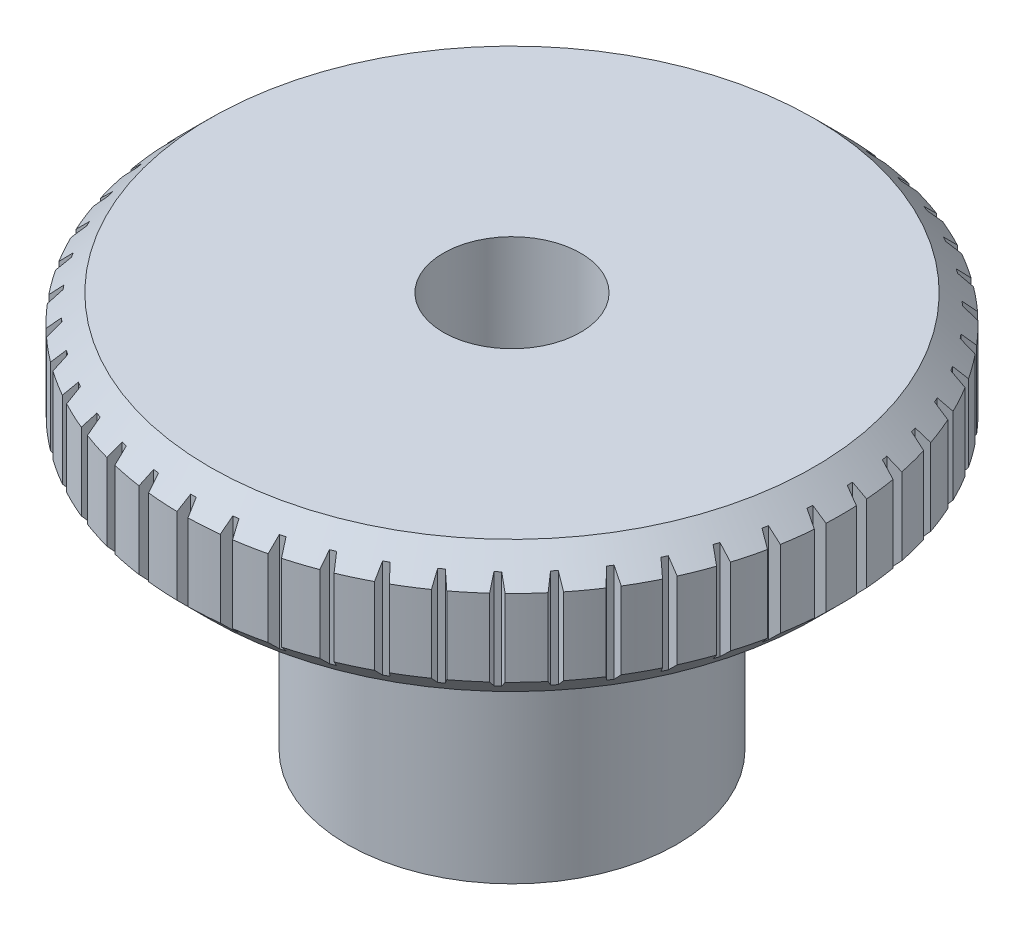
from build123d import *

# Parameters (mm, degrees)
CHAMFER_1_SIZE      = 0.5
CUT_EXTRUDE_1_DEPTH = 12.128342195


with BuildPart() as part:
    # Sketch 1 → Revolve 1 (revolve)
    with BuildSketch(Plane.XY, mode=Mode.PRIVATE) as revolve_1_sk:
        Polygon((1.25, 0), (1.25, 7.2), (6, 7.2), (6, 4.8), (3, 4.8), (3, 0), align=None)
    revolve(revolve_1_sk.sketch.rotate(Axis((0, 14.403409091, 0), (0, -1, 0)), 90), axis=Axis((0, 14.403409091, 0), (0, -1, 0)))

    # Chamfer 1
    chamfer_1_edges = [part.edges().sort_by_distance(p)[0] for p in [
        (0, 4.8, -6),
        (0, 7.2, -6),
    ]]
    chamfer(chamfer_1_edges, length=CHAMFER_1_SIZE)

    # Sketch 2 → Cut-Extrude 1 (cut, through all)
    with BuildSketch(Plane(origin=(0, 7.2, 0), x_dir=(1, 0, 0), z_dir=(0, 1, 0))):
        with BuildLine():
            Line((-0.1, 5.999166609), (-0.05, 5.8))
            Line((-0.05, 5.8), (0.05, 5.8))
            Line((0.05, 5.8), (0.1, 5.999166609))
            ThreePointArc((0.1, 5.999166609), (0, 6), (-0.1, 5.999166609))
        make_face()
        with BuildLine():
            Line((0.77653849, 5.747998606), (0.85110642, 5.939328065))
            ThreePointArc((0.85110642, 5.939328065), (0.751999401, 5.952688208), (0.65268348, 5.964394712))
            Line((0.65268348, 5.964394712), (0.67732702, 5.760531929))
            Line((0.67732702, 5.760531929), (0.77653849, 5.747998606))
        make_face()
        with BuildLine():
            Line((1.490830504, 5.60534784), (1.588790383, 5.785822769))
            ThreePointArc((1.588790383, 5.785822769), (1.492139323, 5.811498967), (1.395073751, 5.835560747))
            Line((1.395073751, 5.835560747), (1.393972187, 5.630216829))
            Line((1.393972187, 5.630216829), (1.490830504, 5.60534784))
        make_face()
        with BuildLine():
            Line((2.18161123, 5.374297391), (2.301418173, 5.541071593))
            ThreePointArc((2.301418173, 5.541071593), (2.208747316, 5.578658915), (2.115462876, 5.614696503))
            Line((2.115462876, 5.614696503), (2.088633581, 5.411109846))
            Line((2.088633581, 5.411109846), (2.18161123, 5.374297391))
        make_face()
        with BuildLine():
            Line((2.837986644, 5.058491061), (2.977751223, 5.208934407))
            ThreePointArc((2.977751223, 5.208934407), (2.890522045, 5.25784008), (2.802489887, 5.305285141))
            Line((2.802489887, 5.305285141), (2.750355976, 5.106666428))
            Line((2.750355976, 5.106666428), (2.837986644, 5.058491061))
        make_face()
        with BuildLine():
            Line((3.449605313, 4.662909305), (3.607123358, 4.794649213))
            ThreePointArc((3.607123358, 4.794649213), (3.526711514, 4.854101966), (3.445319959, 4.912206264))
            Line((3.445319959, 4.912206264), (3.368703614, 4.72168783))
            Line((3.368703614, 4.72168783), (3.449605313, 4.662909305))
        make_face()
        with BuildLine():
            Line((4.006821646, 4.193790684), (4.179609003, 4.304749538))
            ThreePointArc((4.179609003, 4.304749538), (4.107282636, 4.373811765), (4.033815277, 4.441658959))
            Line((4.033815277, 4.441658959), (3.933924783, 4.262245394))
            Line((3.933924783, 4.262245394), (4.006821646, 4.193790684))
        make_face()
        with BuildLine():
            Line((4.500848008, 3.658533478), (4.686179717, 3.746961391))
            ThreePointArc((4.686179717, 3.746961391), (4.623079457, 3.824543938), (4.558694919, 3.901064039))
            Line((4.558694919, 3.901064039), (4.437105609, 3.735584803))
            Line((4.437105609, 3.735584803), (4.500848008, 3.658533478))
        make_face()
        with BuildLine():
            Line((4.923893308, 3.065579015), (5.118846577, 3.130081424))
            ThreePointArc((5.118846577, 3.130081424), (5.065967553, 3.21496077), (5.011681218, 3.298947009))
            Line((5.011681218, 3.298947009), (4.870310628, 3.150011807))
            Line((4.870310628, 3.150011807), (4.923893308, 3.065579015))
        make_face()
        with BuildLine():
            Line((5.269285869, 2.424278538), (5.470786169, 2.463838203))
            ThreePointArc((5.470786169, 2.463838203), (5.428962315, 2.554675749), (5.385630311, 2.644803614))
            Line((5.385630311, 2.644803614), (5.22670794, 2.514761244))
            Line((5.22670794, 2.514761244), (5.269285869, 2.424278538))
        make_face()
        with BuildLine():
            Line((5.531578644, 1.744745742), (5.736448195, 1.758738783))
            ThreePointArc((5.736448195, 1.758738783), (5.706339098, 1.854101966), (5.674644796, 1.948950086))
            Line((5.674644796, 1.948950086), (5.500676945, 1.839851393))
            Line((5.500676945, 1.839851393), (5.531578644, 1.744745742))
        make_face()
        with BuildLine():
            Line((5.70663512, 1.037697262), (5.911643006, 1.025903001))
            ThreePointArc((5.911643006, 1.025903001), (5.893723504, 1.124287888), (5.874166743, 1.222360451))
            Line((5.874166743, 1.222360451), (5.687896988, 1.135925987))
            Line((5.687896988, 1.135925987), (5.70663512, 1.037697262))
        make_face()
        with BuildLine():
            Line((5.791694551, 0.314283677), (5.993607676, 0.276888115))
            ThreePointArc((5.993607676, 0.276888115), (5.988160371, 0.376743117), (5.981049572, 0.476493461))
            Line((5.981049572, 0.476493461), (5.785415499, 0.41408635))
            Line((5.785415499, 0.41408635), (5.791694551, 0.314283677))
        make_face()
        with BuildLine():
            Line((5.785415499, -0.41408635), (5.981049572, -0.476493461))
            ThreePointArc((5.981049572, -0.476493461), (5.988160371, -0.376743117), (5.993607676, -0.276888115))
            Line((5.993607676, -0.276888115), (5.791694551, -0.314283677))
            Line((5.791694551, -0.314283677), (5.785415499, -0.41408635))
        make_face()
        with BuildLine():
            Line((5.687896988, -1.135925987), (5.874166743, -1.222360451))
            ThreePointArc((5.874166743, -1.222360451), (5.893723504, -1.124287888), (5.911643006, -1.025903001))
            Line((5.911643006, -1.025903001), (5.70663512, -1.037697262))
            Line((5.70663512, -1.037697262), (5.687896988, -1.135925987))
        make_face()
        with BuildLine():
            Line((5.500676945, -1.839851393), (5.674644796, -1.948950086))
            ThreePointArc((5.674644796, -1.948950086), (5.706339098, -1.854101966), (5.736448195, -1.758738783))
            Line((5.736448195, -1.758738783), (5.531578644, -1.744745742))
            Line((5.531578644, -1.744745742), (5.500676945, -1.839851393))
        make_face()
        with BuildLine():
            Line((5.22670794, -2.514761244), (5.385630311, -2.644803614))
            ThreePointArc((5.385630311, -2.644803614), (5.428962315, -2.554675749), (5.470786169, -2.463838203))
            Line((5.470786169, -2.463838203), (5.269285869, -2.424278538))
            Line((5.269285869, -2.424278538), (5.22670794, -2.514761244))
        make_face()
        with BuildLine():
            Line((4.870310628, -3.150011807), (5.011681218, -3.298947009))
            ThreePointArc((5.011681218, -3.298947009), (5.065967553, -3.21496077), (5.118846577, -3.130081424))
            Line((5.118846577, -3.130081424), (4.923893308, -3.065579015))
            Line((4.923893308, -3.065579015), (4.870310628, -3.150011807))
        make_face()
        with BuildLine():
            Line((4.437105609, -3.735584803), (4.558694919, -3.901064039))
            ThreePointArc((4.558694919, -3.901064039), (4.623079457, -3.824543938), (4.686179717, -3.746961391))
            Line((4.686179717, -3.746961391), (4.500848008, -3.658533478))
            Line((4.500848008, -3.658533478), (4.437105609, -3.735584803))
        make_face()
        with BuildLine():
            Line((3.933924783, -4.262245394), (4.033815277, -4.441658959))
            ThreePointArc((4.033815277, -4.441658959), (4.107282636, -4.373811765), (4.179609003, -4.304749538))
            Line((4.179609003, -4.304749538), (4.006821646, -4.193790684))
            Line((4.006821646, -4.193790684), (3.933924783, -4.262245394))
        make_face()
        with BuildLine():
            Line((3.368703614, -4.72168783), (3.445319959, -4.912206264))
            ThreePointArc((3.445319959, -4.912206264), (3.526711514, -4.854101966), (3.607123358, -4.794649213))
            Line((3.607123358, -4.794649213), (3.449605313, -4.662909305))
            Line((3.449605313, -4.662909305), (3.368703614, -4.72168783))
        make_face()
        with BuildLine():
            Line((2.750355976, -5.106666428), (2.802489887, -5.305285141))
            ThreePointArc((2.802489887, -5.305285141), (2.890522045, -5.25784008), (2.977751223, -5.208934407))
            Line((2.977751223, -5.208934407), (2.837986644, -5.058491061))
            Line((2.837986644, -5.058491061), (2.750355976, -5.106666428))
        make_face()
        with BuildLine():
            Line((2.088633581, -5.411109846), (2.115462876, -5.614696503))
            ThreePointArc((2.115462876, -5.614696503), (2.208747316, -5.578658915), (2.301418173, -5.541071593))
            Line((2.301418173, -5.541071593), (2.18161123, -5.374297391))
            Line((2.18161123, -5.374297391), (2.088633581, -5.411109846))
        make_face()
        with BuildLine():
            Line((1.393972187, -5.630216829), (1.395073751, -5.835560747))
            ThreePointArc((1.395073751, -5.835560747), (1.492139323, -5.811498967), (1.588790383, -5.785822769))
            Line((1.588790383, -5.785822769), (1.490830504, -5.60534784))
            Line((1.490830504, -5.60534784), (1.393972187, -5.630216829))
        make_face()
        with BuildLine():
            Line((0.67732702, -5.760531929), (0.65268348, -5.964394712))
            ThreePointArc((0.65268348, -5.964394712), (0.751999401, -5.952688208), (0.85110642, -5.939328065))
            Line((0.85110642, -5.939328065), (0.77653849, -5.747998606))
            Line((0.77653849, -5.747998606), (0.67732702, -5.760531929))
        make_face()
        with BuildLine():
            Line((-0.05, -5.8), (-0.1, -5.999166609))
            ThreePointArc((-0.1, -5.999166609), (0, -6), (0.1, -5.999166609))
            Line((0.1, -5.999166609), (0.05, -5.8))
            Line((0.05, -5.8), (-0.05, -5.8))
        make_face()
        with BuildLine():
            Line((-0.77653849, -5.747998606), (-0.85110642, -5.939328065))
            ThreePointArc((-0.85110642, -5.939328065), (-0.751999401, -5.952688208), (-0.65268348, -5.964394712))
            Line((-0.65268348, -5.964394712), (-0.67732702, -5.760531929))
            Line((-0.67732702, -5.760531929), (-0.77653849, -5.747998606))
        make_face()
        with BuildLine():
            Line((-1.490830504, -5.60534784), (-1.588790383, -5.785822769))
            ThreePointArc((-1.588790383, -5.785822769), (-1.492139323, -5.811498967), (-1.395073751, -5.835560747))
            Line((-1.395073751, -5.835560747), (-1.393972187, -5.630216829))
            Line((-1.393972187, -5.630216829), (-1.490830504, -5.60534784))
        make_face()
        with BuildLine():
            Line((-2.18161123, -5.374297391), (-2.301418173, -5.541071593))
            ThreePointArc((-2.301418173, -5.541071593), (-2.208747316, -5.578658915), (-2.115462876, -5.614696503))
            Line((-2.115462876, -5.614696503), (-2.088633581, -5.411109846))
            Line((-2.088633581, -5.411109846), (-2.18161123, -5.374297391))
        make_face()
        with BuildLine():
            Line((-2.837986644, -5.058491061), (-2.977751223, -5.208934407))
            ThreePointArc((-2.977751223, -5.208934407), (-2.890522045, -5.25784008), (-2.802489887, -5.305285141))
            Line((-2.802489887, -5.305285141), (-2.750355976, -5.106666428))
            Line((-2.750355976, -5.106666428), (-2.837986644, -5.058491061))
        make_face()
        with BuildLine():
            Line((-3.449605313, -4.662909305), (-3.607123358, -4.794649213))
            ThreePointArc((-3.607123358, -4.794649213), (-3.526711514, -4.854101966), (-3.445319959, -4.912206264))
            Line((-3.445319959, -4.912206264), (-3.368703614, -4.72168783))
            Line((-3.368703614, -4.72168783), (-3.449605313, -4.662909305))
        make_face()
        with BuildLine():
            Line((-4.006821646, -4.193790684), (-4.179609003, -4.304749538))
            ThreePointArc((-4.179609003, -4.304749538), (-4.107282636, -4.373811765), (-4.033815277, -4.441658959))
            Line((-4.033815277, -4.441658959), (-3.933924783, -4.262245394))
            Line((-3.933924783, -4.262245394), (-4.006821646, -4.193790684))
        make_face()
        with BuildLine():
            Line((-4.500848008, -3.658533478), (-4.686179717, -3.746961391))
            ThreePointArc((-4.686179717, -3.746961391), (-4.623079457, -3.824543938), (-4.558694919, -3.901064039))
            Line((-4.558694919, -3.901064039), (-4.437105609, -3.735584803))
            Line((-4.437105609, -3.735584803), (-4.500848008, -3.658533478))
        make_face()
        with BuildLine():
            Line((-4.923893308, -3.065579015), (-5.118846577, -3.130081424))
            ThreePointArc((-5.118846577, -3.130081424), (-5.065967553, -3.21496077), (-5.011681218, -3.298947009))
            Line((-5.011681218, -3.298947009), (-4.870310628, -3.150011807))
            Line((-4.870310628, -3.150011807), (-4.923893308, -3.065579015))
        make_face()
        with BuildLine():
            Line((-5.269285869, -2.424278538), (-5.470786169, -2.463838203))
            ThreePointArc((-5.470786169, -2.463838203), (-5.428962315, -2.554675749), (-5.385630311, -2.644803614))
            Line((-5.385630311, -2.644803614), (-5.22670794, -2.514761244))
            Line((-5.22670794, -2.514761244), (-5.269285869, -2.424278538))
        make_face()
        with BuildLine():
            Line((-5.531578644, -1.744745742), (-5.736448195, -1.758738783))
            ThreePointArc((-5.736448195, -1.758738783), (-5.706339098, -1.854101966), (-5.674644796, -1.948950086))
            Line((-5.674644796, -1.948950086), (-5.500676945, -1.839851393))
            Line((-5.500676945, -1.839851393), (-5.531578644, -1.744745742))
        make_face()
        with BuildLine():
            Line((-5.70663512, -1.037697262), (-5.911643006, -1.025903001))
            ThreePointArc((-5.911643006, -1.025903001), (-5.893723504, -1.124287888), (-5.874166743, -1.222360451))
            Line((-5.874166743, -1.222360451), (-5.687896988, -1.135925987))
            Line((-5.687896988, -1.135925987), (-5.70663512, -1.037697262))
        make_face()
        with BuildLine():
            Line((-5.791694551, -0.314283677), (-5.993607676, -0.276888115))
            ThreePointArc((-5.993607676, -0.276888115), (-5.988160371, -0.376743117), (-5.981049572, -0.476493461))
            Line((-5.981049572, -0.476493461), (-5.785415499, -0.41408635))
            Line((-5.785415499, -0.41408635), (-5.791694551, -0.314283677))
        make_face()
        with BuildLine():
            Line((-5.785415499, 0.41408635), (-5.981049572, 0.476493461))
            ThreePointArc((-5.981049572, 0.476493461), (-5.988160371, 0.376743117), (-5.993607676, 0.276888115))
            Line((-5.993607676, 0.276888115), (-5.791694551, 0.314283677))
            Line((-5.791694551, 0.314283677), (-5.785415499, 0.41408635))
        make_face()
        with BuildLine():
            Line((-5.687896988, 1.135925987), (-5.874166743, 1.222360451))
            ThreePointArc((-5.874166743, 1.222360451), (-5.893723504, 1.124287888), (-5.911643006, 1.025903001))
            Line((-5.911643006, 1.025903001), (-5.70663512, 1.037697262))
            Line((-5.70663512, 1.037697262), (-5.687896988, 1.135925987))
        make_face()
        with BuildLine():
            Line((-5.500676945, 1.839851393), (-5.674644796, 1.948950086))
            ThreePointArc((-5.674644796, 1.948950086), (-5.706339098, 1.854101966), (-5.736448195, 1.758738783))
            Line((-5.736448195, 1.758738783), (-5.531578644, 1.744745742))
            Line((-5.531578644, 1.744745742), (-5.500676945, 1.839851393))
        make_face()
        with BuildLine():
            Line((-5.22670794, 2.514761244), (-5.385630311, 2.644803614))
            ThreePointArc((-5.385630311, 2.644803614), (-5.428962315, 2.554675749), (-5.470786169, 2.463838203))
            Line((-5.470786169, 2.463838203), (-5.269285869, 2.424278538))
            Line((-5.269285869, 2.424278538), (-5.22670794, 2.514761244))
        make_face()
        with BuildLine():
            Line((-4.870310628, 3.150011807), (-5.011681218, 3.298947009))
            ThreePointArc((-5.011681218, 3.298947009), (-5.065967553, 3.21496077), (-5.118846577, 3.130081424))
            Line((-5.118846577, 3.130081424), (-4.923893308, 3.065579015))
            Line((-4.923893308, 3.065579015), (-4.870310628, 3.150011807))
        make_face()
        with BuildLine():
            Line((-4.437105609, 3.735584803), (-4.558694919, 3.901064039))
            ThreePointArc((-4.558694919, 3.901064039), (-4.623079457, 3.824543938), (-4.686179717, 3.746961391))
            Line((-4.686179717, 3.746961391), (-4.500848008, 3.658533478))
            Line((-4.500848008, 3.658533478), (-4.437105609, 3.735584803))
        make_face()
        with BuildLine():
            Line((-3.933924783, 4.262245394), (-4.033815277, 4.441658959))
            ThreePointArc((-4.033815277, 4.441658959), (-4.107282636, 4.373811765), (-4.179609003, 4.304749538))
            Line((-4.179609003, 4.304749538), (-4.006821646, 4.193790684))
            Line((-4.006821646, 4.193790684), (-3.933924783, 4.262245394))
        make_face()
        with BuildLine():
            Line((-3.368703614, 4.72168783), (-3.445319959, 4.912206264))
            ThreePointArc((-3.445319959, 4.912206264), (-3.526711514, 4.854101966), (-3.607123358, 4.794649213))
            Line((-3.607123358, 4.794649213), (-3.449605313, 4.662909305))
            Line((-3.449605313, 4.662909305), (-3.368703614, 4.72168783))
        make_face()
        with BuildLine():
            Line((-2.750355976, 5.106666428), (-2.802489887, 5.305285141))
            ThreePointArc((-2.802489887, 5.305285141), (-2.890522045, 5.25784008), (-2.977751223, 5.208934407))
            Line((-2.977751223, 5.208934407), (-2.837986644, 5.058491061))
            Line((-2.837986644, 5.058491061), (-2.750355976, 5.106666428))
        make_face()
        with BuildLine():
            Line((-2.088633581, 5.411109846), (-2.115462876, 5.614696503))
            ThreePointArc((-2.115462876, 5.614696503), (-2.208747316, 5.578658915), (-2.301418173, 5.541071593))
            Line((-2.301418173, 5.541071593), (-2.18161123, 5.374297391))
            Line((-2.18161123, 5.374297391), (-2.088633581, 5.411109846))
        make_face()
        with BuildLine():
            Line((-1.393972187, 5.630216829), (-1.395073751, 5.835560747))
            ThreePointArc((-1.395073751, 5.835560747), (-1.492139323, 5.811498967), (-1.588790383, 5.785822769))
            Line((-1.588790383, 5.785822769), (-1.490830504, 5.60534784))
            Line((-1.490830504, 5.60534784), (-1.393972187, 5.630216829))
        make_face()
        with BuildLine():
            Line((-0.67732702, 5.760531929), (-0.65268348, 5.964394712))
            ThreePointArc((-0.65268348, 5.964394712), (-0.751999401, 5.952688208), (-0.85110642, 5.939328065))
            Line((-0.85110642, 5.939328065), (-0.77653849, 5.747998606))
            Line((-0.77653849, 5.747998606), (-0.67732702, 5.760531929))
        make_face()
    extrude(amount=-CUT_EXTRUDE_1_DEPTH, mode=Mode.SUBTRACT)


solid = part.part
